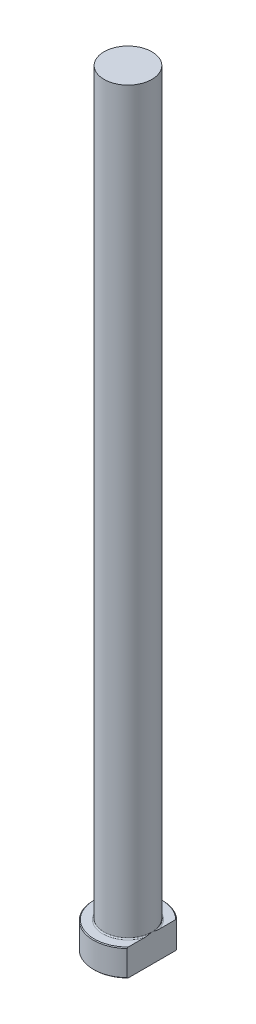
from build123d import *
from build123d.topology import SkipClean

# Parameters (mm, degrees)
CHAMFER1_SIZE = 0.2
FILLET1_R     = 0.3
KEY_DEPTH     = 201.404590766


with BuildPart() as part:
    # Sketch1 → Revolve1 (revolve)
    with BuildSketch(Plane.XY, mode=Mode.PRIVATE) as revolve1_sk:
        Polygon((0, 0), (-9, 0), (-9, 7), (-6.25, 7), (-6.25, 200), (0, 200), align=None)
    revolve(revolve1_sk.sketch.rotate(Axis((0, 259.958771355, 0), (0, -1, 0)), 270), axis=Axis((0, 259.958771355, 0), (0, -1, 0)))

    # Chamfer1
    chamfer1_edges = [part.edges().sort_by_distance(p)[0] for p in [
        (0, 7, -9),
        (0, 0, -9),
    ]]
    chamfer(chamfer1_edges, length=CHAMFER1_SIZE)

    # Fillet1
    fillet1_edges = [part.edges().sort_by_distance(p)[0] for p in [
        (0, 7, -6.25),
    ]]
    fillet(fillet1_edges, radius=FILLET1_R)

    # Sketch2 → KEY (cut, through all)
    with SkipClean():  # the faces are left unmerged after this step: merging them gives an invalid solid
        with BuildSketch(Plane(origin=(0, 0, 0), x_dir=(1, 0, 0), z_dir=(0, 1, 0))):
            with BuildLine():
                Line((6.25, 6.475916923), (6.25, -6.475916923))
                ThreePointArc((6.25, -6.475916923), (9, 0), (6.25, 6.475916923))
            make_face()
        extrude(amount=KEY_DEPTH, mode=Mode.SUBTRACT)


solid = part.part
